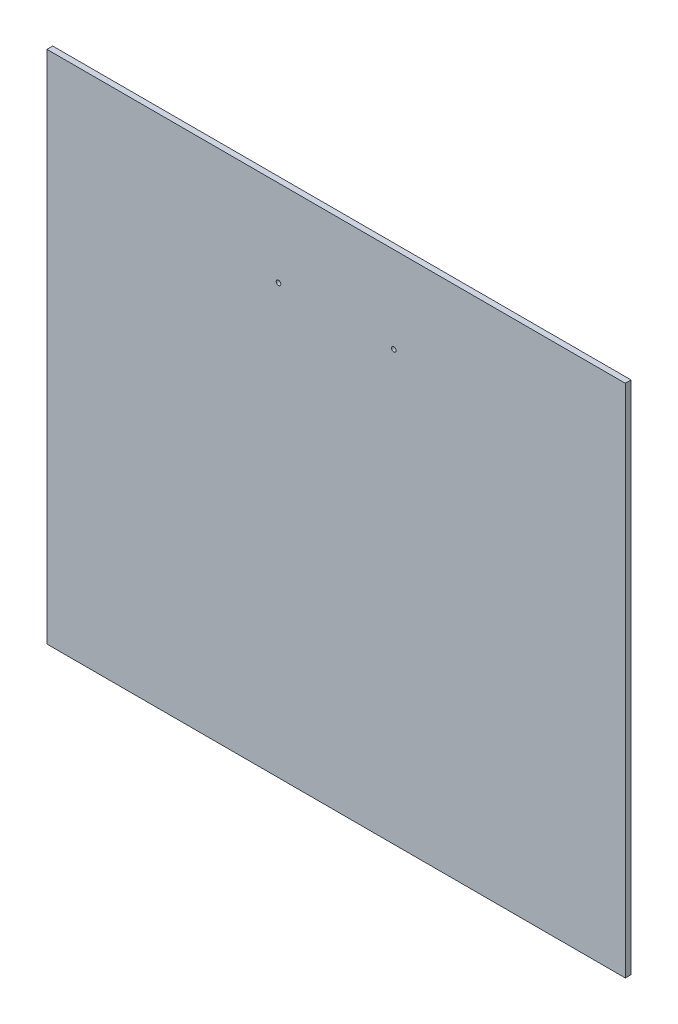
ISO-10303-21;
HEADER;
FILE_DESCRIPTION(('STEP AP214'),'2;1');
FILE_NAME('part.step','',(''),(''),'','','');
FILE_SCHEMA(('AUTOMOTIVE_DESIGN { 1 0 10303 214 1 1 1 1 }'));
ENDSEC;
DATA;
#1=APPLICATION_CONTEXT('core data for automotive mechanical design processes');
#2=APPLICATION_PROTOCOL_DEFINITION('international standard','automotive_design',2000,#1);
#3=PRODUCT_CONTEXT('',#1,'mechanical');
#4=PRODUCT('Part','Part','',(#3));
#5=PRODUCT_RELATED_PRODUCT_CATEGORY('part','',(#4));
#6=PRODUCT_DEFINITION_FORMATION('','',#4);
#7=PRODUCT_DEFINITION_CONTEXT('part definition',#1,'design');
#8=PRODUCT_DEFINITION('design','',#6,#7);
#9=PRODUCT_DEFINITION_SHAPE('','',#8);
#10=(LENGTH_UNIT() NAMED_UNIT(*) SI_UNIT(.MILLI.,.METRE.));
#11=(NAMED_UNIT(*) PLANE_ANGLE_UNIT() SI_UNIT($,.RADIAN.));
#12=(NAMED_UNIT(*) SI_UNIT($,.STERADIAN.) SOLID_ANGLE_UNIT());
#13=UNCERTAINTY_MEASURE_WITH_UNIT(LENGTH_MEASURE(1.E-05),#10,'distance_accuracy_value','');
#14=(GEOMETRIC_REPRESENTATION_CONTEXT(3) GLOBAL_UNCERTAINTY_ASSIGNED_CONTEXT((#13)) GLOBAL_UNIT_ASSIGNED_CONTEXT((#10,
#11,#12)) REPRESENTATION_CONTEXT('',''));
#15=CARTESIAN_POINT('',(0.,0.,0.));
#16=DIRECTION('',(0.,0.,1.));
#17=DIRECTION('',(1.,0.,0.));
#18=AXIS2_PLACEMENT_3D('',#15,#16,#17);
#19=CARTESIAN_POINT('',(-502.,0.,10.));
#20=DIRECTION('',(1.,0.,0.));
#21=DIRECTION('',(0.,1.,0.));
#22=AXIS2_PLACEMENT_3D('',#19,#20,#21);
#23=PLANE('',#22);
#24=DIRECTION('',(0.,-1.,0.));
#25=VECTOR('',#24,1.);
#26=CARTESIAN_POINT('',(-502.,0.,0.));
#27=LINE('',#26,#25);
#28=CARTESIAN_POINT('',(-502.,0.,0.));
#29=VERTEX_POINT('',#28);
#30=CARTESIAN_POINT('',(-502.,-894.,0.));
#31=VERTEX_POINT('',#30);
#32=EDGE_CURVE('E112',#29,#31,#27,.T.);
#33=ORIENTED_EDGE('',*,*,#32,.T.);
#34=DIRECTION('',(0.,0.,-1.));
#35=VECTOR('',#34,1.);
#36=CARTESIAN_POINT('',(-502.,-894.,10.));
#37=LINE('',#36,#35);
#38=CARTESIAN_POINT('',(-502.,-894.,10.));
#39=VERTEX_POINT('',#38);
#40=EDGE_CURVE('E11',#39,#31,#37,.T.);
#41=ORIENTED_EDGE('',*,*,#40,.F.);
#42=DIRECTION('',(0.,-1.,0.));
#43=VECTOR('',#42,1.);
#44=CARTESIAN_POINT('',(-502.,0.,10.));
#45=LINE('',#44,#43);
#46=CARTESIAN_POINT('',(-502.,0.,10.));
#47=VERTEX_POINT('',#46);
#48=EDGE_CURVE('E94',#47,#39,#45,.T.);
#49=ORIENTED_EDGE('',*,*,#48,.F.);
#50=DIRECTION('',(0.,0.,-1.));
#51=VECTOR('',#50,1.);
#52=CARTESIAN_POINT('',(-502.,0.,10.));
#53=LINE('',#52,#51);
#54=EDGE_CURVE('E108',#47,#29,#53,.T.);
#55=ORIENTED_EDGE('',*,*,#54,.T.);
#56=EDGE_LOOP('',(#33,#41,#49,#55));
#57=FACE_BOUND('',#56,.T.);
#58=ADVANCED_FACE('F42',(#57),#23,.F.);
#59=CARTESIAN_POINT('',(-502.,-894.,10.));
#60=DIRECTION('',(0.,1.,0.));
#61=DIRECTION('',(0.,0.,1.));
#62=AXIS2_PLACEMENT_3D('',#59,#60,#61);
#63=PLANE('',#62);
#64=DIRECTION('',(1.,0.,0.));
#65=VECTOR('',#64,1.);
#66=CARTESIAN_POINT('',(-502.,-894.,0.));
#67=LINE('',#66,#65);
#68=CARTESIAN_POINT('',(502.,-894.,0.));
#69=VERTEX_POINT('',#68);
#70=EDGE_CURVE('E99',#31,#69,#67,.T.);
#71=ORIENTED_EDGE('',*,*,#70,.T.);
#72=DIRECTION('',(0.,0.,-1.));
#73=VECTOR('',#72,1.);
#74=CARTESIAN_POINT('',(502.,-894.,10.));
#75=LINE('',#74,#73);
#76=CARTESIAN_POINT('',(502.,-894.,10.));
#77=VERTEX_POINT('',#76);
#78=EDGE_CURVE('E51',#77,#69,#75,.T.);
#79=ORIENTED_EDGE('',*,*,#78,.F.);
#80=DIRECTION('',(1.,0.,0.));
#81=VECTOR('',#80,1.);
#82=CARTESIAN_POINT('',(-502.,-894.,10.));
#83=LINE('',#82,#81);
#84=EDGE_CURVE('E89',#39,#77,#83,.T.);
#85=ORIENTED_EDGE('',*,*,#84,.F.);
#86=ORIENTED_EDGE('',*,*,#40,.T.);
#87=EDGE_LOOP('',(#71,#79,#85,#86));
#88=FACE_BOUND('',#87,.T.);
#89=ADVANCED_FACE('F98',(#88),#63,.F.);
#90=CARTESIAN_POINT('',(502.,0.,10.));
#91=DIRECTION('',(-1.,0.,0.));
#92=DIRECTION('',(0.,-1.,0.));
#93=AXIS2_PLACEMENT_3D('',#90,#91,#92);
#94=PLANE('',#93);
#95=DIRECTION('',(0.,1.,0.));
#96=VECTOR('',#95,1.);
#97=CARTESIAN_POINT('',(502.,0.,0.));
#98=LINE('',#97,#96);
#99=CARTESIAN_POINT('',(502.,0.,0.));
#100=VERTEX_POINT('',#99);
#101=EDGE_CURVE('E76',#69,#100,#98,.T.);
#102=ORIENTED_EDGE('',*,*,#101,.T.);
#103=DIRECTION('',(0.,0.,-1.));
#104=VECTOR('',#103,1.);
#105=CARTESIAN_POINT('',(502.,0.,10.));
#106=LINE('',#105,#104);
#107=CARTESIAN_POINT('',(502.,0.,10.));
#108=VERTEX_POINT('',#107);
#109=EDGE_CURVE('E101',#108,#100,#106,.T.);
#110=ORIENTED_EDGE('',*,*,#109,.F.);
#111=DIRECTION('',(0.,1.,0.));
#112=VECTOR('',#111,1.);
#113=CARTESIAN_POINT('',(502.,0.,10.));
#114=LINE('',#113,#112);
#115=EDGE_CURVE('E92',#77,#108,#114,.T.);
#116=ORIENTED_EDGE('',*,*,#115,.F.);
#117=ORIENTED_EDGE('',*,*,#78,.T.);
#118=EDGE_LOOP('',(#102,#110,#116,#117));
#119=FACE_BOUND('',#118,.T.);
#120=ADVANCED_FACE('F102',(#119),#94,.F.);
#121=CARTESIAN_POINT('',(-502.,0.,10.));
#122=DIRECTION('',(0.,-1.,0.));
#123=DIRECTION('',(0.,0.,-1.));
#124=AXIS2_PLACEMENT_3D('',#121,#122,#123);
#125=PLANE('',#124);
#126=DIRECTION('',(-1.,0.,0.));
#127=VECTOR('',#126,1.);
#128=CARTESIAN_POINT('',(-502.,0.,0.));
#129=LINE('',#128,#127);
#130=EDGE_CURVE('E82',#100,#29,#129,.T.);
#131=ORIENTED_EDGE('',*,*,#130,.T.);
#132=ORIENTED_EDGE('',*,*,#54,.F.);
#133=DIRECTION('',(-1.,0.,0.));
#134=VECTOR('',#133,1.);
#135=CARTESIAN_POINT('',(-502.,0.,10.));
#136=LINE('',#135,#134);
#137=EDGE_CURVE('E59',#108,#47,#136,.T.);
#138=ORIENTED_EDGE('',*,*,#137,.F.);
#139=ORIENTED_EDGE('',*,*,#109,.T.);
#140=EDGE_LOOP('',(#131,#132,#138,#139));
#141=FACE_BOUND('',#140,.T.);
#142=ADVANCED_FACE('F127',(#141),#125,.F.);
#143=CARTESIAN_POINT('',(0.,0.,10.));
#144=DIRECTION('',(0.,0.,1.));
#145=DIRECTION('',(1.,0.,0.));
#146=AXIS2_PLACEMENT_3D('',#143,#144,#145);
#147=PLANE('',#146);
#148=CARTESIAN_POINT('',(100.,-150.,10.));
#149=DIRECTION('',(0.,0.,1.));
#150=DIRECTION('',(1.,0.,0.));
#151=AXIS2_PLACEMENT_3D('',#148,#149,#150);
#152=CIRCLE('',#151,4.00000000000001);
#153=CARTESIAN_POINT('',(104.,-150.,10.));
#154=VERTEX_POINT('',#153);
#155=EDGE_CURVE('E144',#154,#154,#152,.T.);
#156=ORIENTED_EDGE('',*,*,#155,.F.);
#157=EDGE_LOOP('',(#156));
#158=FACE_BOUND('',#157,.T.);
#159=CARTESIAN_POINT('',(-100.,-150.,10.));
#160=DIRECTION('',(0.,0.,1.));
#161=DIRECTION('',(1.,0.,0.));
#162=AXIS2_PLACEMENT_3D('',#159,#160,#161);
#163=CIRCLE('',#162,4.00000000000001);
#164=CARTESIAN_POINT('',(-96.,-150.,10.));
#165=VERTEX_POINT('',#164);
#166=EDGE_CURVE('E136',#165,#165,#163,.T.);
#167=ORIENTED_EDGE('',*,*,#166,.F.);
#168=EDGE_LOOP('',(#167));
#169=FACE_BOUND('',#168,.T.);
#170=ORIENTED_EDGE('',*,*,#48,.T.);
#171=ORIENTED_EDGE('',*,*,#84,.T.);
#172=ORIENTED_EDGE('',*,*,#115,.T.);
#173=ORIENTED_EDGE('',*,*,#137,.T.);
#174=EDGE_LOOP('',(#170,#171,#172,#173));
#175=FACE_BOUND('',#174,.T.);
#176=ADVANCED_FACE('F90',(#158,#169,#175),#147,.T.);
#177=CARTESIAN_POINT('',(0.,0.,0.));
#178=DIRECTION('',(0.,0.,1.));
#179=DIRECTION('',(1.,0.,0.));
#180=AXIS2_PLACEMENT_3D('',#177,#178,#179);
#181=PLANE('',#180);
#182=CARTESIAN_POINT('',(100.,-150.,0.));
#183=DIRECTION('',(0.,0.,1.));
#184=DIRECTION('',(1.,0.,0.));
#185=AXIS2_PLACEMENT_3D('',#182,#183,#184);
#186=CIRCLE('',#185,4.00000000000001);
#187=CARTESIAN_POINT('',(104.,-150.,0.));
#188=VERTEX_POINT('',#187);
#189=EDGE_CURVE('E116',#188,#188,#186,.T.);
#190=ORIENTED_EDGE('',*,*,#189,.T.);
#191=EDGE_LOOP('',(#190));
#192=FACE_BOUND('',#191,.T.);
#193=CARTESIAN_POINT('',(-100.,-150.,0.));
#194=DIRECTION('',(0.,0.,1.));
#195=DIRECTION('',(1.,0.,0.));
#196=AXIS2_PLACEMENT_3D('',#193,#194,#195);
#197=CIRCLE('',#196,4.00000000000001);
#198=CARTESIAN_POINT('',(-96.,-150.,0.));
#199=VERTEX_POINT('',#198);
#200=EDGE_CURVE('E140',#199,#199,#197,.T.);
#201=ORIENTED_EDGE('',*,*,#200,.T.);
#202=EDGE_LOOP('',(#201));
#203=FACE_BOUND('',#202,.T.);
#204=ORIENTED_EDGE('',*,*,#32,.F.);
#205=ORIENTED_EDGE('',*,*,#130,.F.);
#206=ORIENTED_EDGE('',*,*,#101,.F.);
#207=ORIENTED_EDGE('',*,*,#70,.F.);
#208=EDGE_LOOP('',(#204,#205,#206,#207));
#209=FACE_BOUND('',#208,.T.);
#210=ADVANCED_FACE('F130',(#192,#203,#209),#181,.F.);
#211=CARTESIAN_POINT('',(-100.,-150.,0.));
#212=DIRECTION('',(0.,0.,1.));
#213=DIRECTION('',(1.,0.,0.));
#214=AXIS2_PLACEMENT_3D('',#211,#212,#213);
#215=CYLINDRICAL_SURFACE('',#214,4.00000000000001);
#216=ORIENTED_EDGE('',*,*,#200,.F.);
#217=EDGE_LOOP('',(#216));
#218=FACE_BOUND('',#217,.T.);
#219=ORIENTED_EDGE('',*,*,#166,.T.);
#220=EDGE_LOOP('',(#219));
#221=FACE_BOUND('',#220,.T.);
#222=ADVANCED_FACE('F158',(#218,#221),#215,.F.);
#223=CARTESIAN_POINT('',(100.,-150.,0.));
#224=DIRECTION('',(0.,0.,1.));
#225=DIRECTION('',(1.,0.,0.));
#226=AXIS2_PLACEMENT_3D('',#223,#224,#225);
#227=CYLINDRICAL_SURFACE('',#226,4.00000000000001);
#228=ORIENTED_EDGE('',*,*,#189,.F.);
#229=EDGE_LOOP('',(#228));
#230=FACE_BOUND('',#229,.T.);
#231=ORIENTED_EDGE('',*,*,#155,.T.);
#232=EDGE_LOOP('',(#231));
#233=FACE_BOUND('',#232,.T.);
#234=ADVANCED_FACE('F155',(#230,#233),#227,.F.);
#235=CLOSED_SHELL('',(#58,#89,#120,#142,#176,#210,#222,#234));
#236=MANIFOLD_SOLID_BREP('B2',#235);
#237=ADVANCED_BREP_SHAPE_REPRESENTATION('',(#18,#236),#14);
#238=SHAPE_DEFINITION_REPRESENTATION(#9,#237);
ENDSEC;
END-ISO-10303-21;
